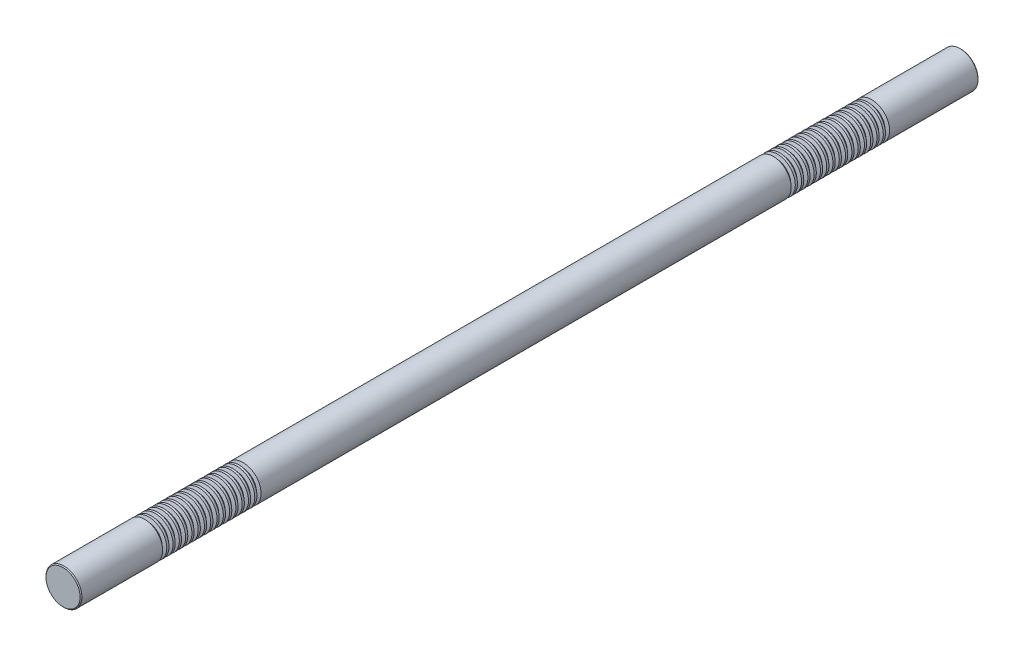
from build123d import *

# Parameters (mm, degrees)
SKETCH1_R           = 20
BOSS_EXTRUDE1_DEPTH = 500
CHAMFER1_SIZE       = 1
LPATTERN1_COUNT     = 16
LPATTERN1_PITCH     = 7
LPATTERN2_COUNT     = 2
LPATTERN2_PITCH     = 700


with BuildPart() as part:
    # Sketch1 → Boss-Extrude1 (new, symmetric)
    with BuildSketch(Plane.XY):
        Circle(SKETCH1_R)
    extrude(amount=BOSS_EXTRUDE1_DEPTH, both=True)

    # Chamfer1
    chamfer1_edges = [part.edges().sort_by_distance(p)[0] for p in [
        (-20, 0, -500),
        (-20, 0, 500),
    ]]
    chamfer(chamfer1_edges, length=CHAMFER1_SIZE)

    # Sketch2 → Cut-Revolve1 (revolve, cut)
    with BuildSketch(Plane(origin=(0, 0, 0), x_dir=(0, 0, -1), z_dir=(1, 0, 0)), mode=Mode.PRIVATE) as cut_revolve1_sk:
        Polygon((400.535898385, 20), (395.964101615, 20), (397.035898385, 16), (399.464101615, 16), align=None)
    cut_revolve1 = revolve(cut_revolve1_sk.sketch.rotate(Axis((0, 0, 500), (0, 0, -1)), 90), axis=Axis((0, 0, 500), (0, 0, -1)), mode=Mode.SUBTRACT)

    # LPattern1: Cut-Revolve1 ×16
    with Locations(*[(0, 0, i * LPATTERN1_PITCH) for i in range(1, LPATTERN1_COUNT)]):
        add(cut_revolve1, mode=Mode.SUBTRACT)

    # LPattern2: Cut-Revolve1 ×2
    with Locations(*[(0, 0, i * LPATTERN2_PITCH) for i in range(1, LPATTERN2_COUNT)]):
        add(cut_revolve1, mode=Mode.SUBTRACT)

    # LPattern2 copy 1 sketch → LPattern2 copy 1 (revolve, cut)
    with BuildSketch(Plane(origin=(0, 0, 707), x_dir=(0, 0, -1), z_dir=(1, 0, 0))):
        Polygon((400.535898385, 20), (395.964101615, 20), (397.035898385, 16), (399.464101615, 16), align=None)
    revolve(axis=Axis((0, 0, 1207), (0, 0, -1)), mode=Mode.SUBTRACT)

    # LPattern2 copy 2 sketch → LPattern2 copy 2 (revolve, cut)
    with BuildSketch(Plane(origin=(0, 0, 714), x_dir=(0, 0, -1), z_dir=(1, 0, 0))):
        Polygon((400.535898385, 20), (395.964101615, 20), (397.035898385, 16), (399.464101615, 16), align=None)
    revolve(axis=Axis((0, 0, 1214), (0, 0, -1)), mode=Mode.SUBTRACT)

    # LPattern2 copy 3 sketch → LPattern2 copy 3 (revolve, cut)
    with BuildSketch(Plane(origin=(0, 0, 721), x_dir=(0, 0, -1), z_dir=(1, 0, 0))):
        Polygon((400.535898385, 20), (395.964101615, 20), (397.035898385, 16), (399.464101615, 16), align=None)
    revolve(axis=Axis((0, 0, 1221), (0, 0, -1)), mode=Mode.SUBTRACT)

    # LPattern2 copy 4 sketch → LPattern2 copy 4 (revolve, cut)
    with BuildSketch(Plane(origin=(0, 0, 728), x_dir=(0, 0, -1), z_dir=(1, 0, 0))):
        Polygon((400.535898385, 20), (395.964101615, 20), (397.035898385, 16), (399.464101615, 16), align=None)
    revolve(axis=Axis((0, 0, 1228), (0, 0, -1)), mode=Mode.SUBTRACT)

    # LPattern2 copy 5 sketch → LPattern2 copy 5 (revolve, cut)
    with BuildSketch(Plane(origin=(0, 0, 735), x_dir=(0, 0, -1), z_dir=(1, 0, 0))):
        Polygon((400.535898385, 20), (395.964101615, 20), (397.035898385, 16), (399.464101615, 16), align=None)
    revolve(axis=Axis((0, 0, 1235), (0, 0, -1)), mode=Mode.SUBTRACT)

    # LPattern2 copy 6 sketch → LPattern2 copy 6 (revolve, cut)
    with BuildSketch(Plane(origin=(0, 0, 742), x_dir=(0, 0, -1), z_dir=(1, 0, 0))):
        Polygon((400.535898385, 20), (395.964101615, 20), (397.035898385, 16), (399.464101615, 16), align=None)
    revolve(axis=Axis((0, 0, 1242), (0, 0, -1)), mode=Mode.SUBTRACT)

    # LPattern2 copy 7 sketch → LPattern2 copy 7 (revolve, cut)
    with BuildSketch(Plane(origin=(0, 0, 749), x_dir=(0, 0, -1), z_dir=(1, 0, 0))):
        Polygon((400.535898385, 20), (395.964101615, 20), (397.035898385, 16), (399.464101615, 16), align=None)
    revolve(axis=Axis((0, 0, 1249), (0, 0, -1)), mode=Mode.SUBTRACT)

    # LPattern2 copy 8 sketch → LPattern2 copy 8 (revolve, cut)
    with BuildSketch(Plane(origin=(0, 0, 756), x_dir=(0, 0, -1), z_dir=(1, 0, 0))):
        Polygon((400.535898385, 20), (395.964101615, 20), (397.035898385, 16), (399.464101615, 16), align=None)
    revolve(axis=Axis((0, 0, 1256), (0, 0, -1)), mode=Mode.SUBTRACT)

    # LPattern2 copy 9 sketch → LPattern2 copy 9 (revolve, cut)
    with BuildSketch(Plane(origin=(0, 0, 763), x_dir=(0, 0, -1), z_dir=(1, 0, 0))):
        Polygon((400.535898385, 20), (395.964101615, 20), (397.035898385, 16), (399.464101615, 16), align=None)
    revolve(axis=Axis((0, 0, 1263), (0, 0, -1)), mode=Mode.SUBTRACT)

    # LPattern2 copy 10 sketch → LPattern2 copy 10 (revolve, cut)
    with BuildSketch(Plane(origin=(0, 0, 770), x_dir=(0, 0, -1), z_dir=(1, 0, 0))):
        Polygon((400.535898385, 20), (395.964101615, 20), (397.035898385, 16), (399.464101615, 16), align=None)
    revolve(axis=Axis((0, 0, 1270), (0, 0, -1)), mode=Mode.SUBTRACT)

    # LPattern2 copy 11 sketch → LPattern2 copy 11 (revolve, cut)
    with BuildSketch(Plane(origin=(0, 0, 777), x_dir=(0, 0, -1), z_dir=(1, 0, 0))):
        Polygon((400.535898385, 20), (395.964101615, 20), (397.035898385, 16), (399.464101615, 16), align=None)
    revolve(axis=Axis((0, 0, 1277), (0, 0, -1)), mode=Mode.SUBTRACT)

    # LPattern2 copy 12 sketch → LPattern2 copy 12 (revolve, cut)
    with BuildSketch(Plane(origin=(0, 0, 784), x_dir=(0, 0, -1), z_dir=(1, 0, 0))):
        Polygon((400.535898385, 20), (395.964101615, 20), (397.035898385, 16), (399.464101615, 16), align=None)
    revolve(axis=Axis((0, 0, 1284), (0, 0, -1)), mode=Mode.SUBTRACT)

    # LPattern2 copy 13 sketch → LPattern2 copy 13 (revolve, cut)
    with BuildSketch(Plane(origin=(0, 0, 791), x_dir=(0, 0, -1), z_dir=(1, 0, 0))):
        Polygon((400.535898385, 20), (395.964101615, 20), (397.035898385, 16), (399.464101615, 16), align=None)
    revolve(axis=Axis((0, 0, 1291), (0, 0, -1)), mode=Mode.SUBTRACT)

    # LPattern2 copy 14 sketch → LPattern2 copy 14 (revolve, cut)
    with BuildSketch(Plane(origin=(0, 0, 798), x_dir=(0, 0, -1), z_dir=(1, 0, 0))):
        Polygon((400.535898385, 20), (395.964101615, 20), (397.035898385, 16), (399.464101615, 16), align=None)
    revolve(axis=Axis((0, 0, 1298), (0, 0, -1)), mode=Mode.SUBTRACT)

    # LPattern2 copy 15 sketch → LPattern2 copy 15 (revolve, cut)
    with BuildSketch(Plane(origin=(0, 0, 805), x_dir=(0, 0, -1), z_dir=(1, 0, 0))):
        Polygon((400.535898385, 20), (395.964101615, 20), (397.035898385, 16), (399.464101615, 16), align=None)
    revolve(axis=Axis((0, 0, 1305), (0, 0, -1)), mode=Mode.SUBTRACT)


solid = part.part
